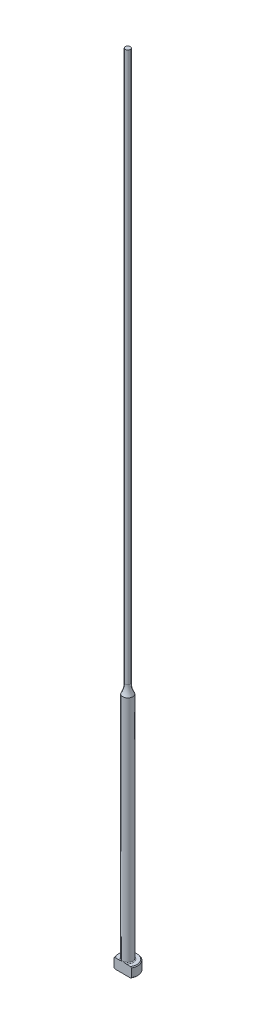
from build123d import *

# Parameters (mm, degrees)
CHAMFER1_SIZE      = 0.254
FILLET1_R          = 0.254
CUT_EXTRUDE1_DEPTH = 255.0396844


with BuildPart() as part:
    # Sketch1 → Revolve1 (revolve)
    with BuildSketch(Plane.XY, mode=Mode.PRIVATE) as revolve1_sk:
        with BuildLine():
            Line((0, 0), (-3.175, 0))
            Line((-3.175, 0), (-3.175, 3.175))
            Line((-3.175, 3.175), (-1.5875, 3.175))
            Line((-1.5875, 3.175), (-1.5875, 76.2))
            ThreePointArc((-1.5875, 76.2), (-0.995388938, 77.686680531), (-0.79375, 79.274180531))
            Line((-0.79375, 79.274180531), (-0.79375, 254))
            Line((-0.79375, 254), (0, 254))
            Line((0, 254), (0, 0))
        make_face()
    revolve(revolve1_sk.sketch.rotate(Axis((0, 259.958771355, 0), (0, -1, 0)), 270), axis=Axis((0, 259.958771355, 0), (0, -1, 0)))

    # Chamfer1
    chamfer1_edges = [part.edges().sort_by_distance(p)[0] for p in [
        (0, 0, -3.175),
        (0, 3.175, -3.175),
    ]]
    chamfer(chamfer1_edges, length=CHAMFER1_SIZE)

    # Fillet1
    fillet1_edges = [part.edges().sort_by_distance(p)[0] for p in [
        (0, 3.175, -1.5875),
    ]]
    fillet(fillet1_edges, radius=FILLET1_R)

    # Sketch2 → Cut-Extrude1 (cut, through all)
    with BuildSketch(Plane.XZ):
        with BuildLine():
            Line((-2.749630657, 1.5875), (2.749630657, 1.5875))
            ThreePointArc((2.749630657, 1.5875), (0, 3.175), (-2.749630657, 1.5875))
        make_face()
    extrude(amount=-CUT_EXTRUDE1_DEPTH, mode=Mode.SUBTRACT)


solid = part.part
